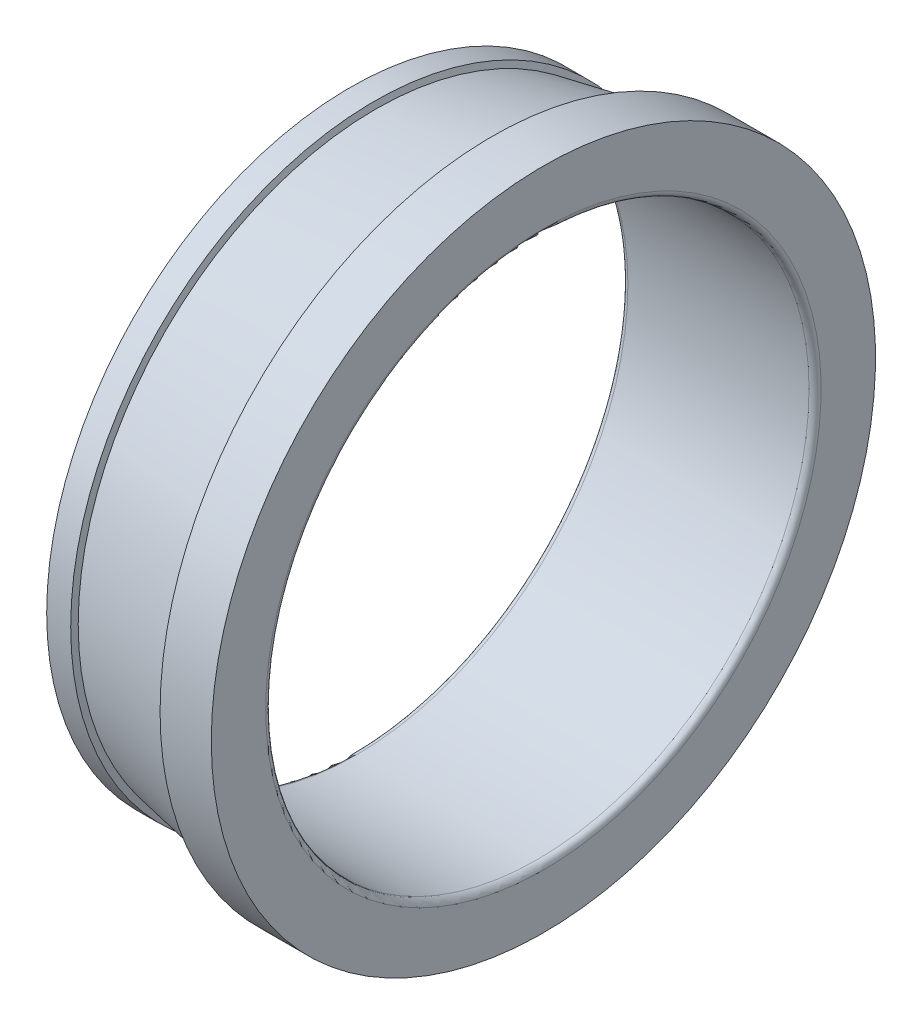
from build123d import *


with BuildPart() as part:
    # Esquisse1 → Base-R_volution (revolve)
    with BuildSketch(Plane(origin=(0, 0, 0), x_dir=(1, 0, 0), z_dir=(0, 1, 0)), mode=Mode.PRIVATE) as base_r_volution_sk:
        with BuildLine():
            Line((31, 45), (1, 45))
            ThreePointArc((1, 45), (0.292893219, 45.292893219), (0, 46))
            Line((0, 46), (0, 50.284391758))
            Line((0, 50.284391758), (3.981345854, 50.284391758))
            Line((3.981345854, 50.284391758), (4.224824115, 49.284391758))
            Line((4.224824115, 49.284391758), (24, 53.015237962))
            Line((24, 53.015237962), (23.513043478, 55.015237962))
            Line((23.513043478, 55.015237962), (32, 55.015237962))
            Line((32, 55.015237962), (32, 46))
            ThreePointArc((32, 46), (31.707106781, 45.292893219), (31, 45))
        make_face()
    revolve(base_r_volution_sk.sketch.rotate(Axis((0, 0, 0), (1, 0, 0)), 180), axis=Axis((0, 0, 0), (1, 0, 0)))


solid = part.part
